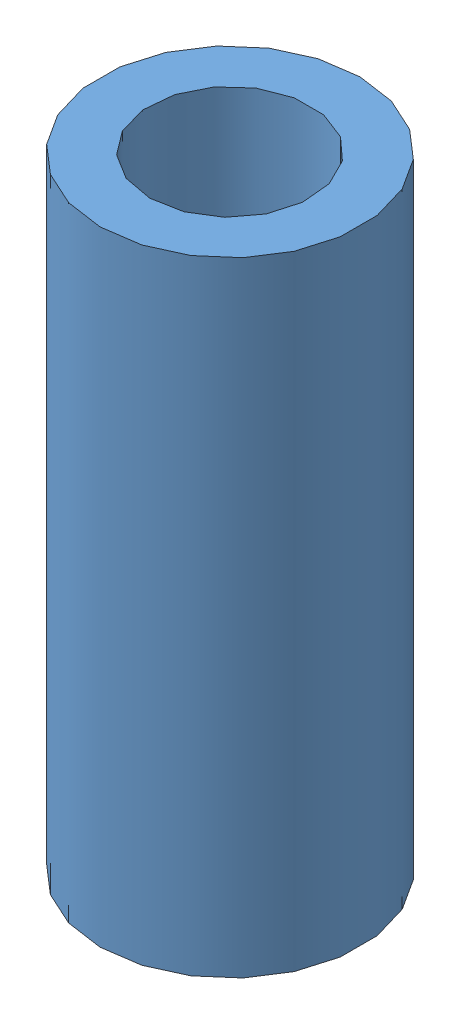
SolidWorks assembly Switch Magnet assy short.SLDASM, configuration Default (file format 17000). Lengths in mm.
Overall size (15.88 38.1 15.88).
4 component instances, 3 part files, 6 mates.
Components (placement in the parent):
- mag cyl fixture-1: mag cyl fixture.SLDPRT [Default] at (-13.6033 -5.5831 10.9714) size (15.88 38.1 15.88)
- Hex Machine Screw Nuts (U.S.)-1: Hex Machine Screw Nuts (U.S.).SLDPRT [[24]   #8 -32] at (-13.6033 -8.7581 10.9714) x (1 0 0) z (0 1 0) (suppressed, hidden)
- Flat Head SCS (U.S.)-1: Flat Head SCS (U.S.).SLDPRT [[347]  #8 -32 UNC x 1] at (-13.6033 1.1613 10.9714) x (0.951288 0 0.308305) z (-0.308305 0 0.951288) (suppressed, hidden)
- Hex Machine Screw Nuts (U.S.)-2: Hex Machine Screw Nuts (U.S.).SLDPRT [[24]   #8 -32] at (-13.6033 -21.1948 10.9714) x (1 0 0) z (0 1 0) (suppressed, hidden)
Mates (geometry in assembly coordinates):
- Concentric3: concentric aligned: cylinder of mag cyl fixture-1 through (-13.6033 0.7669 10.9714) axis (0 1 0) radius 2.2479; cylinder of Flat Head SCS (U.S.)-1 through (-13.6033 26.5613 10.9714) axis (0 1 0) radius 2.0828
- Coincident1: coincident aligned: cone of mag cyl fixture-1 through (-13.6033 0.7669 10.9714) axis (0 -1 0); cylinder of Flat Head SCS (U.S.)-1 through (-13.6033 -1.6876 10.9714) axis (0 -1 0) radius 715.585
- Concentric5: concentric: cylinder of Hex Machine Screw Nuts (U.S.)-1 through (-13.6033 -5.5831 10.9714) axis (0 -1 0) radius 2.0828; cylinder of Flat Head SCS (U.S.)-1 through (-13.6033 26.5613 10.9714) axis (0 1 0) radius 2.0828
- Coincident2: coincident anti-aligned: plane of mag cyl fixture-1 through (-13.6033 -5.5831 10.9714) normal (0 -1 0); plane of Hex Machine Screw Nuts (U.S.)-1 through (-9.2377 -5.5831 3.4099) normal (0 1 0)
- Concentric6: concentric: cylinder of Flat Head SCS (U.S.)-1 through (-13.6033 26.5613 10.9714) axis (0 1 0) radius 2.0828; cylinder of Hex Machine Screw Nuts (U.S.)-2 through (-13.6033 -18.0198 10.9714) axis (0 -1 0) radius 2.0828
- Distance1: distance = 3.048 mm: plane of Flat Head SCS (U.S.)-1 through (-11.622 -24.2428 11.6135) normal (0 -1 0); plane of Hex Machine Screw Nuts (U.S.)-2 through (-9.2377 -21.1948 3.4099) normal (0 -1 0)
